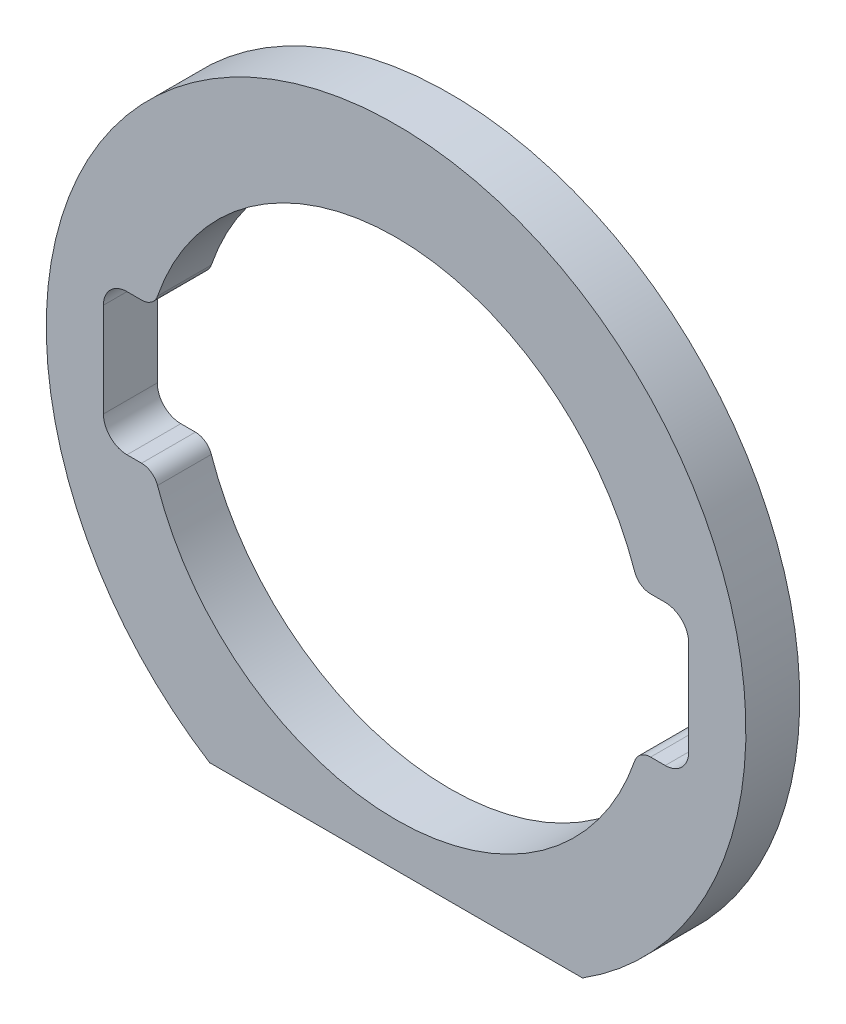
from build123d import *

# Parameters (mm, degrees)
EXTRUDE_1_DEPTH     = 8
CUT_EXTRUDE_1_DEPTH = 10


with BuildPart() as part:
    # Sketch 1 → Extrude 1 (new body)
    with BuildSketch(Plane.XY):
        with BuildLine():
            Line((-27.712812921, -44), (27.712812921, -44))
            ThreePointArc((27.712812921, -44), (0, 52), (-27.712812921, -44))
        make_face()
    extrude(amount=EXTRUDE_1_DEPTH)

    # Sketch 2 → Cut-Extrude 1 (cut)
    with BuildSketch(Plane.XY.offset(8)):
        with BuildLine():
            Line((-40, 10.5), (-37.828560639, 10.5))
            ThreePointArc((-37.828560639, 10.5), (-36.376191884, 10.965147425), (-35.464275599, 12.1875))
            ThreePointArc((-35.464275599, 12.1875), (0, 37.5), (35.464275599, 12.1875))
            ThreePointArc((35.464275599, 12.1875), (36.376191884, 10.965147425), (37.828560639, 10.5))
            Line((37.828560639, 10.5), (40, 10.5))
            ThreePointArc((40, 10.5), (42.474873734, 9.474873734), (43.5, 7))
            Line((43.5, 7), (43.5, -7))
            ThreePointArc((43.5, -7), (42.474873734, -9.474873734), (40, -10.5))
            Line((40, -10.5), (37.828560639, -10.5))
            ThreePointArc((37.828560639, -10.5), (36.376191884, -10.965147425), (35.464275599, -12.1875))
            ThreePointArc((35.464275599, -12.1875), (0, -37.5), (-35.464275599, -12.1875))
            ThreePointArc((-35.464275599, -12.1875), (-36.376191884, -10.965147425), (-37.828560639, -10.5))
            Line((-37.828560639, -10.5), (-40, -10.5))
            ThreePointArc((-40, -10.5), (-42.474873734, -9.474873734), (-43.5, -7))
            Line((-43.5, -7), (-43.5, 7))
            ThreePointArc((-43.5, 7), (-42.474873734, 9.474873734), (-40, 10.5))
        make_face()
    extrude(amount=-CUT_EXTRUDE_1_DEPTH, mode=Mode.SUBTRACT)


solid = part.part
